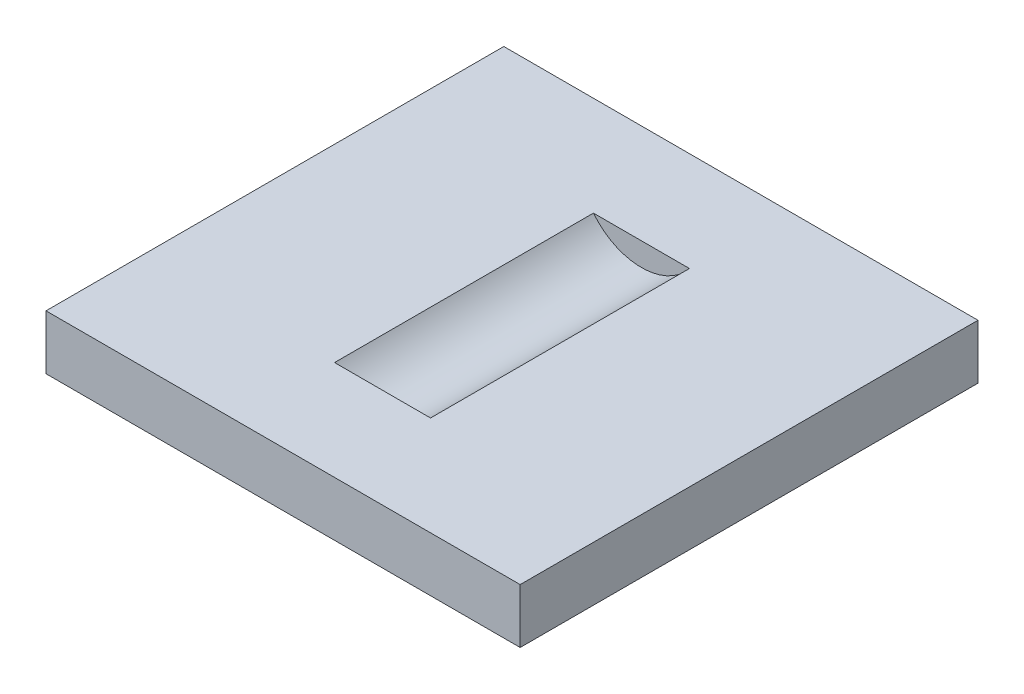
ISO-10303-21;
HEADER;
FILE_DESCRIPTION(('STEP AP214'),'2;1');
FILE_NAME('part.step','',(''),(''),'','','');
FILE_SCHEMA(('AUTOMOTIVE_DESIGN { 1 0 10303 214 1 1 1 1 }'));
ENDSEC;
DATA;
#1=APPLICATION_CONTEXT('core data for automotive mechanical design processes');
#2=APPLICATION_PROTOCOL_DEFINITION('international standard','automotive_design',2000,#1);
#3=PRODUCT_CONTEXT('',#1,'mechanical');
#4=PRODUCT('Part','Part','',(#3));
#5=PRODUCT_RELATED_PRODUCT_CATEGORY('part','',(#4));
#6=PRODUCT_DEFINITION_FORMATION('','',#4);
#7=PRODUCT_DEFINITION_CONTEXT('part definition',#1,'design');
#8=PRODUCT_DEFINITION('design','',#6,#7);
#9=PRODUCT_DEFINITION_SHAPE('','',#8);
#10=(LENGTH_UNIT() NAMED_UNIT(*) SI_UNIT(.MILLI.,.METRE.));
#11=(NAMED_UNIT(*) PLANE_ANGLE_UNIT() SI_UNIT($,.RADIAN.));
#12=(NAMED_UNIT(*) SI_UNIT($,.STERADIAN.) SOLID_ANGLE_UNIT());
#13=UNCERTAINTY_MEASURE_WITH_UNIT(LENGTH_MEASURE(1.E-05),#10,'distance_accuracy_value','');
#14=(GEOMETRIC_REPRESENTATION_CONTEXT(3) GLOBAL_UNCERTAINTY_ASSIGNED_CONTEXT((#13)) GLOBAL_UNIT_ASSIGNED_CONTEXT((#10,
#11,#12)) REPRESENTATION_CONTEXT('',''));
#15=CARTESIAN_POINT('',(0.,0.,0.));
#16=DIRECTION('',(0.,0.,1.));
#17=DIRECTION('',(1.,0.,0.));
#18=AXIS2_PLACEMENT_3D('',#15,#16,#17);
#19=CARTESIAN_POINT('',(144.,170.,-31.));
#20=DIRECTION('',(0.,1.,0.));
#21=DIRECTION('',(0.,0.,1.));
#22=AXIS2_PLACEMENT_3D('',#19,#20,#21);
#23=CYLINDRICAL_SURFACE('',#22,37.5);
#24=DIRECTION('',(0.,1.,0.));
#25=VECTOR('',#24,1.);
#26=CARTESIAN_POINT('',(181.5,170.,-31.));
#27=LINE('',#26,#25);
#28=CARTESIAN_POINT('',(181.5,210.,-31.));
#29=VERTEX_POINT('',#28);
#30=CARTESIAN_POINT('',(181.5,179.,-31.));
#31=VERTEX_POINT('',#30);
#32=EDGE_CURVE('E243',#29,#31,#27,.F.);
#33=ORIENTED_EDGE('',*,*,#32,.T.);
#34=CARTESIAN_POINT('',(144.,179.,-31.));
#35=DIRECTION('',(0.,-1.,0.));
#36=DIRECTION('',(0.,0.,-1.));
#37=AXIS2_PLACEMENT_3D('',#34,#35,#36);
#38=CIRCLE('',#37,37.5);
#39=CARTESIAN_POINT('',(106.5,179.,-31.));
#40=VERTEX_POINT('',#39);
#41=EDGE_CURVE('E260',#31,#40,#38,.T.);
#42=ORIENTED_EDGE('',*,*,#41,.T.);
#43=DIRECTION('',(0.,1.,0.));
#44=VECTOR('',#43,1.);
#45=CARTESIAN_POINT('',(106.5,170.,-31.));
#46=LINE('',#45,#44);
#47=CARTESIAN_POINT('',(106.5,210.,-31.));
#48=VERTEX_POINT('',#47);
#49=EDGE_CURVE('E240',#40,#48,#46,.T.);
#50=ORIENTED_EDGE('',*,*,#49,.T.);
#51=CARTESIAN_POINT('',(144.,210.,-31.));
#52=DIRECTION('',(0.,-1.,0.));
#53=DIRECTION('',(1.,0.,0.));
#54=AXIS2_PLACEMENT_3D('',#51,#52,#53);
#55=CIRCLE('',#54,37.5);
#56=EDGE_CURVE('E256',#29,#48,#55,.T.);
#57=ORIENTED_EDGE('',*,*,#56,.F.);
#58=EDGE_LOOP('',(#33,#42,#50,#57));
#59=FACE_BOUND('',#58,.T.);
#60=ADVANCED_FACE('F35',(#59),#23,.F.);
#61=CARTESIAN_POINT('',(144.,170.,-31.));
#62=DIRECTION('',(0.,-1.,0.));
#63=DIRECTION('',(0.,0.,-1.));
#64=AXIS2_PLACEMENT_3D('',#61,#62,#63);
#65=PLANE('',#64);
#66=CARTESIAN_POINT('',(144.,170.,-31.));
#67=DIRECTION('',(0.,-1.,0.));
#68=DIRECTION('',(0.,0.,-1.));
#69=AXIS2_PLACEMENT_3D('',#66,#67,#68);
#70=CIRCLE('',#69,46.5);
#71=CARTESIAN_POINT('',(163.048192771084,170.,-73.4195279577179));
#72=VERTEX_POINT('',#71);
#73=CARTESIAN_POINT('',(124.951807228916,170.,-73.4195279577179));
#74=VERTEX_POINT('',#73);
#75=EDGE_CURVE('E261',#72,#74,#70,.T.);
#76=ORIENTED_EDGE('',*,*,#75,.T.);
#77=CARTESIAN_POINT('',(127.,170.,-68.8582883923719));
#78=DIRECTION('',(0.,-1.,0.));
#79=DIRECTION('',(0.,0.,-1.));
#80=AXIS2_PLACEMENT_3D('',#77,#78,#79);
#81=CIRCLE('',#80,5.);
#82=CARTESIAN_POINT('',(132.,170.,-68.8582883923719));
#83=VERTEX_POINT('',#82);
#84=EDGE_CURVE('E43',#74,#83,#81,.T.);
#85=ORIENTED_EDGE('',*,*,#84,.T.);
#86=DIRECTION('',(0.,0.,1.));
#87=VECTOR('',#86,1.);
#88=CARTESIAN_POINT('',(132.,170.,-31.));
#89=LINE('',#88,#87);
#90=CARTESIAN_POINT('',(132.,170.,-31.));
#91=VERTEX_POINT('',#90);
#92=EDGE_CURVE('E218',#83,#91,#89,.T.);
#93=ORIENTED_EDGE('',*,*,#92,.T.);
#94=CARTESIAN_POINT('',(144.,170.,-31.));
#95=DIRECTION('',(0.,-1.,0.));
#96=DIRECTION('',(0.,0.,-1.));
#97=AXIS2_PLACEMENT_3D('',#94,#95,#96);
#98=CIRCLE('',#97,12.);
#99=CARTESIAN_POINT('',(156.,170.,-31.));
#100=VERTEX_POINT('',#99);
#101=EDGE_CURVE('E215',#91,#100,#98,.F.);
#102=ORIENTED_EDGE('',*,*,#101,.T.);
#103=DIRECTION('',(0.,0.,-1.));
#104=VECTOR('',#103,1.);
#105=CARTESIAN_POINT('',(156.,170.,-31.));
#106=LINE('',#105,#104);
#107=CARTESIAN_POINT('',(156.,170.,-68.8582883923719));
#108=VERTEX_POINT('',#107);
#109=EDGE_CURVE('E230',#100,#108,#106,.T.);
#110=ORIENTED_EDGE('',*,*,#109,.T.);
#111=CARTESIAN_POINT('',(161.,170.,-68.8582883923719));
#112=DIRECTION('',(0.,-1.,0.));
#113=DIRECTION('',(0.,0.,-1.));
#114=AXIS2_PLACEMENT_3D('',#111,#112,#113);
#115=CIRCLE('',#114,5.);
#116=EDGE_CURVE('E277',#108,#72,#115,.T.);
#117=ORIENTED_EDGE('',*,*,#116,.T.);
#118=EDGE_LOOP('',(#76,#85,#93,#102,#110,#117));
#119=FACE_BOUND('',#118,.T.);
#120=ADVANCED_FACE('F281',(#119),#65,.T.);
#121=CARTESIAN_POINT('',(144.,170.,-31.));
#122=DIRECTION('',(0.,1.,0.));
#123=DIRECTION('',(0.,0.,1.));
#124=AXIS2_PLACEMENT_3D('',#121,#122,#123);
#125=CYLINDRICAL_SURFACE('',#124,46.5);
#126=CARTESIAN_POINT('',(144.,179.,-31.));
#127=DIRECTION('',(0.,1.,0.));
#128=DIRECTION('',(0.,0.,1.));
#129=AXIS2_PLACEMENT_3D('',#126,#127,#128);
#130=CIRCLE('',#129,46.5);
#131=CARTESIAN_POINT('',(97.5,179.,-31.));
#132=VERTEX_POINT('',#131);
#133=CARTESIAN_POINT('',(124.951807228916,179.,-73.4195279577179));
#134=VERTEX_POINT('',#133);
#135=EDGE_CURVE('E250',#132,#134,#130,.F.);
#136=ORIENTED_EDGE('',*,*,#135,.T.);
#137=DIRECTION('',(0.,1.,0.));
#138=VECTOR('',#137,1.);
#139=CARTESIAN_POINT('',(124.951807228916,170.,-73.4195279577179));
#140=LINE('',#139,#138);
#141=EDGE_CURVE('E56',#134,#74,#140,.F.);
#142=ORIENTED_EDGE('',*,*,#141,.T.);
#143=ORIENTED_EDGE('',*,*,#75,.F.);
#144=DIRECTION('',(0.,1.,0.));
#145=VECTOR('',#144,1.);
#146=CARTESIAN_POINT('',(163.048192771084,170.,-73.4195279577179));
#147=LINE('',#146,#145);
#148=CARTESIAN_POINT('',(163.048192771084,179.,-73.4195279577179));
#149=VERTEX_POINT('',#148);
#150=EDGE_CURVE('E273',#72,#149,#147,.T.);
#151=ORIENTED_EDGE('',*,*,#150,.T.);
#152=CARTESIAN_POINT('',(190.5,179.,-31.));
#153=VERTEX_POINT('',#152);
#154=EDGE_CURVE('E249',#149,#153,#130,.F.);
#155=ORIENTED_EDGE('',*,*,#154,.T.);
#156=DIRECTION('',(0.,1.,0.));
#157=VECTOR('',#156,1.);
#158=CARTESIAN_POINT('',(190.5,170.,-31.));
#159=LINE('',#158,#157);
#160=CARTESIAN_POINT('',(190.5,210.,-31.));
#161=VERTEX_POINT('',#160);
#162=EDGE_CURVE('E234',#161,#153,#159,.F.);
#163=ORIENTED_EDGE('',*,*,#162,.F.);
#164=CARTESIAN_POINT('',(144.,210.,-31.));
#165=DIRECTION('',(0.,-1.,0.));
#166=DIRECTION('',(0.,0.,-1.));
#167=AXIS2_PLACEMENT_3D('',#164,#165,#166);
#168=CIRCLE('',#167,46.5);
#169=CARTESIAN_POINT('',(97.5,210.,-31.));
#170=VERTEX_POINT('',#169);
#171=EDGE_CURVE('E259',#161,#170,#168,.T.);
#172=ORIENTED_EDGE('',*,*,#171,.T.);
#173=DIRECTION('',(0.,1.,0.));
#174=VECTOR('',#173,1.);
#175=CARTESIAN_POINT('',(97.5,170.,-31.));
#176=LINE('',#175,#174);
#177=EDGE_CURVE('E237',#132,#170,#176,.T.);
#178=ORIENTED_EDGE('',*,*,#177,.F.);
#179=EDGE_LOOP('',(#136,#142,#143,#151,#155,#163,#172,#178));
#180=FACE_BOUND('',#179,.T.);
#181=ADVANCED_FACE('F295',(#180),#125,.T.);
#182=CARTESIAN_POINT('',(144.,179.,-31.));
#183=DIRECTION('',(0.,-1.,0.));
#184=DIRECTION('',(0.,0.,-1.));
#185=AXIS2_PLACEMENT_3D('',#182,#183,#184);
#186=PLANE('',#185);
#187=DIRECTION('',(0.,0.,1.));
#188=VECTOR('',#187,1.);
#189=CARTESIAN_POINT('',(132.,179.,-31.));
#190=LINE('',#189,#188);
#191=CARTESIAN_POINT('',(132.,179.,-68.8582883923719));
#192=VERTEX_POINT('',#191);
#193=CARTESIAN_POINT('',(132.,179.,-31.));
#194=VERTEX_POINT('',#193);
#195=EDGE_CURVE('E224',#192,#194,#190,.T.);
#196=ORIENTED_EDGE('',*,*,#195,.F.);
#197=CARTESIAN_POINT('',(127.,179.,-68.8582883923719));
#198=DIRECTION('',(0.,-1.,0.));
#199=DIRECTION('',(0.,0.,-1.));
#200=AXIS2_PLACEMENT_3D('',#197,#198,#199);
#201=CIRCLE('',#200,5.);
#202=EDGE_CURVE('E271',#192,#134,#201,.F.);
#203=ORIENTED_EDGE('',*,*,#202,.T.);
#204=ORIENTED_EDGE('',*,*,#135,.F.);
#205=DIRECTION('',(-1.,0.,0.));
#206=VECTOR('',#205,1.);
#207=CARTESIAN_POINT('',(97.5,179.,-31.));
#208=LINE('',#207,#206);
#209=EDGE_CURVE('E246',#40,#132,#208,.T.);
#210=ORIENTED_EDGE('',*,*,#209,.F.);
#211=ORIENTED_EDGE('',*,*,#41,.F.);
#212=EDGE_CURVE('E247',#153,#31,#208,.T.);
#213=ORIENTED_EDGE('',*,*,#212,.F.);
#214=ORIENTED_EDGE('',*,*,#154,.F.);
#215=CARTESIAN_POINT('',(161.,179.,-68.8582883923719));
#216=DIRECTION('',(0.,-1.,0.));
#217=DIRECTION('',(0.,0.,-1.));
#218=AXIS2_PLACEMENT_3D('',#215,#216,#217);
#219=CIRCLE('',#218,5.);
#220=CARTESIAN_POINT('',(156.,179.,-68.8582883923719));
#221=VERTEX_POINT('',#220);
#222=EDGE_CURVE('E269',#149,#221,#219,.F.);
#223=ORIENTED_EDGE('',*,*,#222,.T.);
#224=DIRECTION('',(0.,0.,-1.));
#225=VECTOR('',#224,1.);
#226=CARTESIAN_POINT('',(156.,179.,-31.));
#227=LINE('',#226,#225);
#228=CARTESIAN_POINT('',(156.,179.,-31.));
#229=VERTEX_POINT('',#228);
#230=EDGE_CURVE('E222',#229,#221,#227,.T.);
#231=ORIENTED_EDGE('',*,*,#230,.F.);
#232=CARTESIAN_POINT('',(144.,179.,-31.));
#233=DIRECTION('',(0.,1.,0.));
#234=DIRECTION('',(0.,0.,1.));
#235=AXIS2_PLACEMENT_3D('',#232,#233,#234);
#236=CIRCLE('',#235,12.);
#237=EDGE_CURVE('E220',#194,#229,#236,.T.);
#238=ORIENTED_EDGE('',*,*,#237,.F.);
#239=EDGE_LOOP('',(#196,#203,#204,#210,#211,#213,#214,#223,#231,#238));
#240=FACE_BOUND('',#239,.T.);
#241=ADVANCED_FACE('F291',(#240),#186,.F.);
#242=CARTESIAN_POINT('',(97.5,280.001,-31.));
#243=DIRECTION('',(0.,0.,1.));
#244=DIRECTION('',(1.,0.,0.));
#245=AXIS2_PLACEMENT_3D('',#242,#243,#244);
#246=PLANE('',#245);
#247=ORIENTED_EDGE('',*,*,#162,.T.);
#248=ORIENTED_EDGE('',*,*,#212,.T.);
#249=ORIENTED_EDGE('',*,*,#32,.F.);
#250=DIRECTION('',(-1.,0.,0.));
#251=VECTOR('',#250,1.);
#252=CARTESIAN_POINT('',(144.,210.,-31.));
#253=LINE('',#252,#251);
#254=EDGE_CURVE('E255',#161,#29,#253,.T.);
#255=ORIENTED_EDGE('',*,*,#254,.F.);
#256=EDGE_LOOP('',(#247,#248,#249,#255));
#257=FACE_BOUND('',#256,.T.);
#258=ADVANCED_FACE('F309',(#257),#246,.F.);
#259=ORIENTED_EDGE('',*,*,#49,.F.);
#260=ORIENTED_EDGE('',*,*,#209,.T.);
#261=ORIENTED_EDGE('',*,*,#177,.T.);
#262=EDGE_CURVE('E252',#48,#170,#253,.T.);
#263=ORIENTED_EDGE('',*,*,#262,.F.);
#264=EDGE_LOOP('',(#259,#260,#261,#263));
#265=FACE_BOUND('',#264,.T.);
#266=ADVANCED_FACE('F300',(#265),#246,.F.);
#267=CARTESIAN_POINT('',(144.,-0.001000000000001,-31.));
#268=DIRECTION('',(0.,1.,0.));
#269=DIRECTION('',(0.,0.,1.));
#270=AXIS2_PLACEMENT_3D('',#267,#268,#269);
#271=CYLINDRICAL_SURFACE('',#270,12.);
#272=DIRECTION('',(0.,1.,0.));
#273=VECTOR('',#272,1.);
#274=CARTESIAN_POINT('',(132.,-0.001000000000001,-31.));
#275=LINE('',#274,#273);
#276=EDGE_CURVE('E227',#91,#194,#275,.T.);
#277=ORIENTED_EDGE('',*,*,#276,.T.);
#278=ORIENTED_EDGE('',*,*,#237,.T.);
#279=DIRECTION('',(0.,1.,0.));
#280=VECTOR('',#279,1.);
#281=CARTESIAN_POINT('',(156.,-0.001000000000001,-31.));
#282=LINE('',#281,#280);
#283=EDGE_CURVE('E226',#100,#229,#282,.T.);
#284=ORIENTED_EDGE('',*,*,#283,.F.);
#285=ORIENTED_EDGE('',*,*,#101,.F.);
#286=EDGE_LOOP('',(#277,#278,#284,#285));
#287=FACE_BOUND('',#286,.T.);
#288=ADVANCED_FACE('F317',(#287),#271,.F.);
#289=CARTESIAN_POINT('',(132.,-0.001000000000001,-31.));
#290=DIRECTION('',(-1.,0.,0.));
#291=DIRECTION('',(0.,0.,1.));
#292=AXIS2_PLACEMENT_3D('',#289,#290,#291);
#293=PLANE('',#292);
#294=ORIENTED_EDGE('',*,*,#92,.F.);
#295=DIRECTION('',(0.,1.,0.));
#296=VECTOR('',#295,1.);
#297=CARTESIAN_POINT('',(132.,-0.001000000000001,-68.8582883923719));
#298=LINE('',#297,#296);
#299=EDGE_CURVE('E263',#83,#192,#298,.T.);
#300=ORIENTED_EDGE('',*,*,#299,.T.);
#301=ORIENTED_EDGE('',*,*,#195,.T.);
#302=ORIENTED_EDGE('',*,*,#276,.F.);
#303=EDGE_LOOP('',(#294,#300,#301,#302));
#304=FACE_BOUND('',#303,.T.);
#305=ADVANCED_FACE('F287',(#304),#293,.F.);
#306=CARTESIAN_POINT('',(156.,-0.001000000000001,-31.));
#307=DIRECTION('',(1.,0.,0.));
#308=DIRECTION('',(0.,0.,-1.));
#309=AXIS2_PLACEMENT_3D('',#306,#307,#308);
#310=PLANE('',#309);
#311=ORIENTED_EDGE('',*,*,#230,.T.);
#312=DIRECTION('',(0.,1.,0.));
#313=VECTOR('',#312,1.);
#314=CARTESIAN_POINT('',(156.,-0.001000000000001,-68.8582883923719));
#315=LINE('',#314,#313);
#316=EDGE_CURVE('E11',#221,#108,#315,.F.);
#317=ORIENTED_EDGE('',*,*,#316,.T.);
#318=ORIENTED_EDGE('',*,*,#109,.F.);
#319=ORIENTED_EDGE('',*,*,#283,.T.);
#320=EDGE_LOOP('',(#311,#317,#318,#319));
#321=FACE_BOUND('',#320,.T.);
#322=ADVANCED_FACE('F314',(#321),#310,.F.);
#323=CARTESIAN_POINT('',(127.,170.,-68.8582883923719));
#324=DIRECTION('',(0.,1.,0.));
#325=DIRECTION('',(0.,0.,1.));
#326=AXIS2_PLACEMENT_3D('',#323,#324,#325);
#327=CYLINDRICAL_SURFACE('',#326,5.);
#328=ORIENTED_EDGE('',*,*,#84,.F.);
#329=ORIENTED_EDGE('',*,*,#141,.F.);
#330=ORIENTED_EDGE('',*,*,#202,.F.);
#331=ORIENTED_EDGE('',*,*,#299,.F.);
#332=EDGE_LOOP('',(#328,#329,#330,#331));
#333=FACE_BOUND('',#332,.T.);
#334=ADVANCED_FACE('F289',(#333),#327,.T.);
#335=CARTESIAN_POINT('',(161.,170.,-68.8582883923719));
#336=DIRECTION('',(0.,1.,0.));
#337=DIRECTION('',(0.,0.,1.));
#338=AXIS2_PLACEMENT_3D('',#335,#336,#337);
#339=CYLINDRICAL_SURFACE('',#338,5.);
#340=ORIENTED_EDGE('',*,*,#116,.F.);
#341=ORIENTED_EDGE('',*,*,#316,.F.);
#342=ORIENTED_EDGE('',*,*,#222,.F.);
#343=ORIENTED_EDGE('',*,*,#150,.F.);
#344=EDGE_LOOP('',(#340,#341,#342,#343));
#345=FACE_BOUND('',#344,.T.);
#346=ADVANCED_FACE('F37',(#345),#339,.T.);
#347=CARTESIAN_POINT('',(228.,230.,-75.));
#348=DIRECTION('',(0.,-1.,0.));
#349=DIRECTION('',(0.,0.,-1.));
#350=AXIS2_PLACEMENT_3D('',#347,#348,#349);
#351=PLANE('',#350);
#352=DIRECTION('',(1.,0.,0.));
#353=VECTOR('',#352,1.);
#354=CARTESIAN_POINT('',(228.,230.,93.));
#355=LINE('',#354,#353);
#356=CARTESIAN_POINT('',(57.,230.,93.));
#357=VERTEX_POINT('',#356);
#358=CARTESIAN_POINT('',(231.,230.,93.));
#359=VERTEX_POINT('',#358);
#360=EDGE_CURVE('E160',#357,#359,#355,.T.);
#361=ORIENTED_EDGE('',*,*,#360,.T.);
#362=DIRECTION('',(0.,0.,-1.));
#363=VECTOR('',#362,1.);
#364=CARTESIAN_POINT('',(231.,230.,-75.));
#365=LINE('',#364,#363);
#366=CARTESIAN_POINT('',(231.,230.,-75.));
#367=VERTEX_POINT('',#366);
#368=EDGE_CURVE('E175',#359,#367,#365,.T.);
#369=ORIENTED_EDGE('',*,*,#368,.T.);
#370=DIRECTION('',(1.,0.,0.));
#371=VECTOR('',#370,1.);
#372=CARTESIAN_POINT('',(228.,230.,-75.));
#373=LINE('',#372,#371);
#374=CARTESIAN_POINT('',(57.,230.,-75.));
#375=VERTEX_POINT('',#374);
#376=EDGE_CURVE('E201',#375,#367,#373,.T.);
#377=ORIENTED_EDGE('',*,*,#376,.F.);
#378=DIRECTION('',(0.,0.,1.));
#379=VECTOR('',#378,1.);
#380=CARTESIAN_POINT('',(57.,230.,-75.));
#381=LINE('',#380,#379);
#382=EDGE_CURVE('E179',#375,#357,#381,.T.);
#383=ORIENTED_EDGE('',*,*,#382,.T.);
#384=EDGE_LOOP('',(#361,#369,#377,#383));
#385=FACE_BOUND('',#384,.T.);
#386=DIRECTION('',(-1.,0.,0.));
#387=VECTOR('',#386,1.);
#388=CARTESIAN_POINT('',(228.,230.,-38.5));
#389=LINE('',#388,#387);
#390=CARTESIAN_POINT('',(161.613914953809,230.,-38.5));
#391=VERTEX_POINT('',#390);
#392=CARTESIAN_POINT('',(126.386085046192,230.,-38.5));
#393=VERTEX_POINT('',#392);
#394=EDGE_CURVE('E213',#391,#393,#389,.T.);
#395=ORIENTED_EDGE('',*,*,#394,.F.);
#396=DIRECTION('',(0.,0.,1.));
#397=VECTOR('',#396,1.);
#398=CARTESIAN_POINT('',(161.613914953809,230.,-38.5));
#399=LINE('',#398,#397);
#400=CARTESIAN_POINT('',(161.613914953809,230.,56.5));
#401=VERTEX_POINT('',#400);
#402=EDGE_CURVE('E210',#391,#401,#399,.T.);
#403=ORIENTED_EDGE('',*,*,#402,.T.);
#404=DIRECTION('',(-1.,0.,0.));
#405=VECTOR('',#404,1.);
#406=CARTESIAN_POINT('',(228.,230.,56.5));
#407=LINE('',#406,#405);
#408=CARTESIAN_POINT('',(126.386085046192,230.,56.5));
#409=VERTEX_POINT('',#408);
#410=EDGE_CURVE('E202',#401,#409,#407,.T.);
#411=ORIENTED_EDGE('',*,*,#410,.T.);
#412=DIRECTION('',(0.,0.,1.));
#413=VECTOR('',#412,1.);
#414=CARTESIAN_POINT('',(126.386085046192,230.,-38.5));
#415=LINE('',#414,#413);
#416=EDGE_CURVE('E207',#409,#393,#415,.F.);
#417=ORIENTED_EDGE('',*,*,#416,.T.);
#418=EDGE_LOOP('',(#395,#403,#411,#417));
#419=FACE_BOUND('',#418,.T.);
#420=ADVANCED_FACE('F341',(#385,#419),#351,.F.);
#421=CARTESIAN_POINT('',(228.,210.,-75.));
#422=DIRECTION('',(0.,1.,0.));
#423=DIRECTION('',(0.,0.,1.));
#424=AXIS2_PLACEMENT_3D('',#421,#422,#423);
#425=PLANE('',#424);
#426=ORIENTED_EDGE('',*,*,#171,.F.);
#427=ORIENTED_EDGE('',*,*,#254,.T.);
#428=ORIENTED_EDGE('',*,*,#56,.T.);
#429=ORIENTED_EDGE('',*,*,#262,.T.);
#430=EDGE_LOOP('',(#426,#427,#428,#429));
#431=FACE_BOUND('',#430,.T.);
#432=DIRECTION('',(-1.,0.,0.));
#433=VECTOR('',#432,1.);
#434=CARTESIAN_POINT('',(228.,210.,93.));
#435=LINE('',#434,#433);
#436=CARTESIAN_POINT('',(231.,210.,93.));
#437=VERTEX_POINT('',#436);
#438=CARTESIAN_POINT('',(57.,210.,93.));
#439=VERTEX_POINT('',#438);
#440=EDGE_CURVE('E149',#437,#439,#435,.T.);
#441=ORIENTED_EDGE('',*,*,#440,.T.);
#442=DIRECTION('',(0.,0.,1.));
#443=VECTOR('',#442,1.);
#444=CARTESIAN_POINT('',(57.,210.,-75.));
#445=LINE('',#444,#443);
#446=CARTESIAN_POINT('',(57.,210.,-75.));
#447=VERTEX_POINT('',#446);
#448=EDGE_CURVE('E154',#447,#439,#445,.T.);
#449=ORIENTED_EDGE('',*,*,#448,.F.);
#450=DIRECTION('',(-1.,0.,0.));
#451=VECTOR('',#450,1.);
#452=CARTESIAN_POINT('',(228.,210.,-75.));
#453=LINE('',#452,#451);
#454=CARTESIAN_POINT('',(231.,210.,-75.));
#455=VERTEX_POINT('',#454);
#456=EDGE_CURVE('E199',#455,#447,#453,.T.);
#457=ORIENTED_EDGE('',*,*,#456,.F.);
#458=DIRECTION('',(0.,0.,-1.));
#459=VECTOR('',#458,1.);
#460=CARTESIAN_POINT('',(231.,210.,-75.));
#461=LINE('',#460,#459);
#462=EDGE_CURVE('E156',#437,#455,#461,.T.);
#463=ORIENTED_EDGE('',*,*,#462,.F.);
#464=EDGE_LOOP('',(#441,#449,#457,#463));
#465=FACE_BOUND('',#464,.T.);
#466=CARTESIAN_POINT('',(144.,210.,-31.));
#467=DIRECTION('',(0.,-1.,0.));
#468=DIRECTION('',(0.,0.,-1.));
#469=AXIS2_PLACEMENT_3D('',#466,#467,#468);
#470=CIRCLE('',#469,3.49999999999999);
#471=CARTESIAN_POINT('',(144.,210.,-34.5));
#472=VERTEX_POINT('',#471);
#473=EDGE_CURVE('E184',#472,#472,#470,.T.);
#474=ORIENTED_EDGE('',*,*,#473,.F.);
#475=EDGE_LOOP('',(#474));
#476=FACE_BOUND('',#475,.T.);
#477=ADVANCED_FACE('F151',(#431,#465,#476),#425,.F.);
#478=CARTESIAN_POINT('',(0.,0.,-75.));
#479=DIRECTION('',(0.,0.,-1.));
#480=DIRECTION('',(-1.,0.,0.));
#481=AXIS2_PLACEMENT_3D('',#478,#479,#480);
#482=PLANE('',#481);
#483=ORIENTED_EDGE('',*,*,#376,.T.);
#484=DIRECTION('',(0.,1.,0.));
#485=VECTOR('',#484,1.);
#486=CARTESIAN_POINT('',(231.,210.,-75.));
#487=LINE('',#486,#485);
#488=EDGE_CURVE('E185',#455,#367,#487,.T.);
#489=ORIENTED_EDGE('',*,*,#488,.F.);
#490=ORIENTED_EDGE('',*,*,#456,.T.);
#491=DIRECTION('',(0.,1.,0.));
#492=VECTOR('',#491,1.);
#493=CARTESIAN_POINT('',(57.,210.,-75.));
#494=LINE('',#493,#492);
#495=EDGE_CURVE('E174',#447,#375,#494,.T.);
#496=ORIENTED_EDGE('',*,*,#495,.T.);
#497=EDGE_LOOP('',(#483,#489,#490,#496));
#498=FACE_BOUND('',#497,.T.);
#499=ADVANCED_FACE('F347',(#498),#482,.T.);
#500=CARTESIAN_POINT('',(0.,0.,93.));
#501=DIRECTION('',(0.,0.,-1.));
#502=DIRECTION('',(-1.,0.,0.));
#503=AXIS2_PLACEMENT_3D('',#500,#501,#502);
#504=PLANE('',#503);
#505=ORIENTED_EDGE('',*,*,#440,.F.);
#506=DIRECTION('',(0.,1.,0.));
#507=VECTOR('',#506,1.);
#508=CARTESIAN_POINT('',(231.,210.,93.));
#509=LINE('',#508,#507);
#510=EDGE_CURVE('E169',#437,#359,#509,.T.);
#511=ORIENTED_EDGE('',*,*,#510,.T.);
#512=ORIENTED_EDGE('',*,*,#360,.F.);
#513=DIRECTION('',(0.,1.,0.));
#514=VECTOR('',#513,1.);
#515=CARTESIAN_POINT('',(57.,210.,93.));
#516=LINE('',#515,#514);
#517=EDGE_CURVE('E164',#439,#357,#516,.T.);
#518=ORIENTED_EDGE('',*,*,#517,.F.);
#519=EDGE_LOOP('',(#505,#511,#512,#518));
#520=FACE_BOUND('',#519,.T.);
#521=ADVANCED_FACE('F165',(#520),#504,.F.);
#522=CARTESIAN_POINT('',(144.,244.,-38.5));
#523=DIRECTION('',(0.,0.,1.));
#524=DIRECTION('',(1.,0.,0.));
#525=AXIS2_PLACEMENT_3D('',#522,#523,#524);
#526=CYLINDRICAL_SURFACE('',#525,22.5);
#527=CARTESIAN_POINT('',(144.,244.,-38.5));
#528=DIRECTION('',(0.,0.,1.));
#529=DIRECTION('',(1.,0.,0.));
#530=AXIS2_PLACEMENT_3D('',#527,#528,#529);
#531=CIRCLE('',#530,22.5);
#532=EDGE_CURVE('E161',#393,#391,#531,.T.);
#533=ORIENTED_EDGE('',*,*,#532,.F.);
#534=ORIENTED_EDGE('',*,*,#416,.F.);
#535=CARTESIAN_POINT('',(144.,244.,56.5));
#536=DIRECTION('',(0.,0.,1.));
#537=DIRECTION('',(1.,0.,0.));
#538=AXIS2_PLACEMENT_3D('',#535,#536,#537);
#539=CIRCLE('',#538,22.5);
#540=EDGE_CURVE('E192',#409,#401,#539,.T.);
#541=ORIENTED_EDGE('',*,*,#540,.T.);
#542=ORIENTED_EDGE('',*,*,#402,.F.);
#543=EDGE_LOOP('',(#533,#534,#541,#542));
#544=FACE_BOUND('',#543,.T.);
#545=ADVANCED_FACE('F353',(#544),#526,.F.);
#546=CARTESIAN_POINT('',(144.,244.,-38.5));
#547=DIRECTION('',(0.,0.,1.));
#548=DIRECTION('',(1.,0.,0.));
#549=AXIS2_PLACEMENT_3D('',#546,#547,#548);
#550=PLANE('',#549);
#551=ORIENTED_EDGE('',*,*,#394,.T.);
#552=ORIENTED_EDGE('',*,*,#532,.T.);
#553=EDGE_LOOP('',(#551,#552));
#554=FACE_BOUND('',#553,.T.);
#555=ADVANCED_FACE('F359',(#554),#550,.T.);
#556=CARTESIAN_POINT('',(144.,244.,56.5));
#557=DIRECTION('',(0.,0.,1.));
#558=DIRECTION('',(1.,0.,0.));
#559=AXIS2_PLACEMENT_3D('',#556,#557,#558);
#560=PLANE('',#559);
#561=ORIENTED_EDGE('',*,*,#540,.F.);
#562=ORIENTED_EDGE('',*,*,#410,.F.);
#563=EDGE_LOOP('',(#561,#562));
#564=FACE_BOUND('',#563,.T.);
#565=ADVANCED_FACE('F361',(#564),#560,.F.);
#566=CARTESIAN_POINT('',(144.,215.,-31.));
#567=DIRECTION('',(0.,-1.,0.));
#568=DIRECTION('',(0.,0.,-1.));
#569=AXIS2_PLACEMENT_3D('',#566,#567,#568);
#570=CYLINDRICAL_SURFACE('',#569,3.49999999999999);
#571=CARTESIAN_POINT('',(144.,215.,-31.));
#572=DIRECTION('',(0.,-1.,0.));
#573=DIRECTION('',(0.,0.,-1.));
#574=AXIS2_PLACEMENT_3D('',#571,#572,#573);
#575=CIRCLE('',#574,3.49999999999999);
#576=CARTESIAN_POINT('',(144.,215.,-34.5));
#577=VERTEX_POINT('',#576);
#578=EDGE_CURVE('E189',#577,#577,#575,.T.);
#579=ORIENTED_EDGE('',*,*,#578,.F.);
#580=EDGE_LOOP('',(#579));
#581=FACE_BOUND('',#580,.T.);
#582=ORIENTED_EDGE('',*,*,#473,.T.);
#583=EDGE_LOOP('',(#582));
#584=FACE_BOUND('',#583,.T.);
#585=ADVANCED_FACE('F364',(#581,#584),#570,.F.);
#586=CARTESIAN_POINT('',(144.,215.,-31.));
#587=DIRECTION('',(0.,-1.,0.));
#588=DIRECTION('',(0.,0.,-1.));
#589=AXIS2_PLACEMENT_3D('',#586,#587,#588);
#590=PLANE('',#589);
#591=ORIENTED_EDGE('',*,*,#578,.T.);
#592=EDGE_LOOP('',(#591));
#593=FACE_BOUND('',#592,.T.);
#594=ADVANCED_FACE('F371',(#593),#590,.T.);
#595=CARTESIAN_POINT('',(57.,210.,-75.));
#596=DIRECTION('',(-1.,0.,0.));
#597=DIRECTION('',(0.,0.,1.));
#598=AXIS2_PLACEMENT_3D('',#595,#596,#597);
#599=PLANE('',#598);
#600=ORIENTED_EDGE('',*,*,#382,.F.);
#601=ORIENTED_EDGE('',*,*,#495,.F.);
#602=ORIENTED_EDGE('',*,*,#448,.T.);
#603=ORIENTED_EDGE('',*,*,#517,.T.);
#604=EDGE_LOOP('',(#600,#601,#602,#603));
#605=FACE_BOUND('',#604,.T.);
#606=ADVANCED_FACE('F172',(#605),#599,.T.);
#607=CARTESIAN_POINT('',(231.,210.,-75.));
#608=DIRECTION('',(1.,0.,0.));
#609=DIRECTION('',(0.,0.,-1.));
#610=AXIS2_PLACEMENT_3D('',#607,#608,#609);
#611=PLANE('',#610);
#612=ORIENTED_EDGE('',*,*,#368,.F.);
#613=ORIENTED_EDGE('',*,*,#510,.F.);
#614=ORIENTED_EDGE('',*,*,#462,.T.);
#615=ORIENTED_EDGE('',*,*,#488,.T.);
#616=EDGE_LOOP('',(#612,#613,#614,#615));
#617=FACE_BOUND('',#616,.T.);
#618=ADVANCED_FACE('F378',(#617),#611,.T.);
#619=CLOSED_SHELL('',(#60,#120,#181,#241,#258,#266,#288,#305,#322,#334,#346,#420,#477,#499,#521,
#545,#555,#565,#585,#594,#606,#618));
#620=MANIFOLD_SOLID_BREP('B2',#619);
#621=ADVANCED_BREP_SHAPE_REPRESENTATION('',(#18,#620),#14);
#622=SHAPE_DEFINITION_REPRESENTATION(#9,#621);
ENDSEC;
END-ISO-10303-21;
